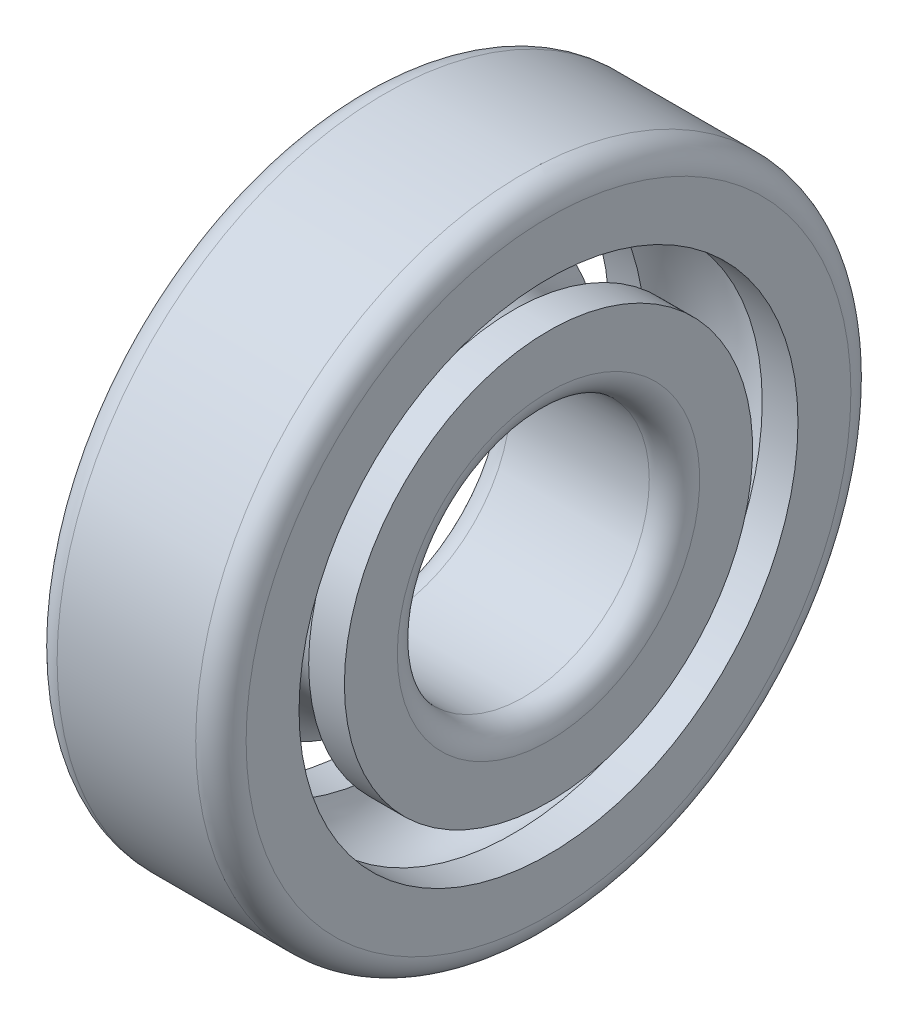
from build123d import *


with BuildPart() as part:
    # Sketch2 → Revolve1 (revolve)
    with BuildSketch(Plane(origin=(0, 0, 0), x_dir=(1, 0, 0), z_dir=(0, 1, 0)), mode=Mode.PRIVATE) as revolve1_sk:
        with BuildLine():
            Line((-2.75, 5), (2.75, 5))
            ThreePointArc((2.75, 5), (3.457106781, 5.292893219), (3.75, 6))
            Line((3.75, 6), (3.75, 8.1))
            Line((3.75, 8.1), (2.332380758, 8.1))
            ThreePointArc((2.332380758, 8.1), (0, 6.5), (-2.332380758, 8.1))
            Line((-2.332380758, 8.1), (-3.75, 8.1))
            Line((-3.75, 8.1), (-3.75, 6))
            ThreePointArc((-3.75, 6), (-3.457106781, 5.292893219), (-2.75, 5))
        make_face()
        with BuildLine():
            Line((2.75, 13), (-2.75, 13))
            ThreePointArc((-2.75, 13), (-3.457106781, 12.707106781), (-3.75, 12))
            Line((-3.75, 12), (-3.75, 9.9))
            Line((-3.75, 9.9), (-2.332380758, 9.9))
            ThreePointArc((-2.332380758, 9.9), (0, 11.5), (2.332380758, 9.9))
            Line((2.332380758, 9.9), (3.75, 9.9))
            Line((3.75, 9.9), (3.75, 12))
            ThreePointArc((3.75, 12), (3.457106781, 12.707106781), (2.75, 13))
        make_face()
    revolve(revolve1_sk.sketch.rotate(Axis((-1.265134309, 0, 0), (1, 0, 0)), 180), axis=Axis((-1.265134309, 0, 0), (1, 0, 0)))


solid = part.part
